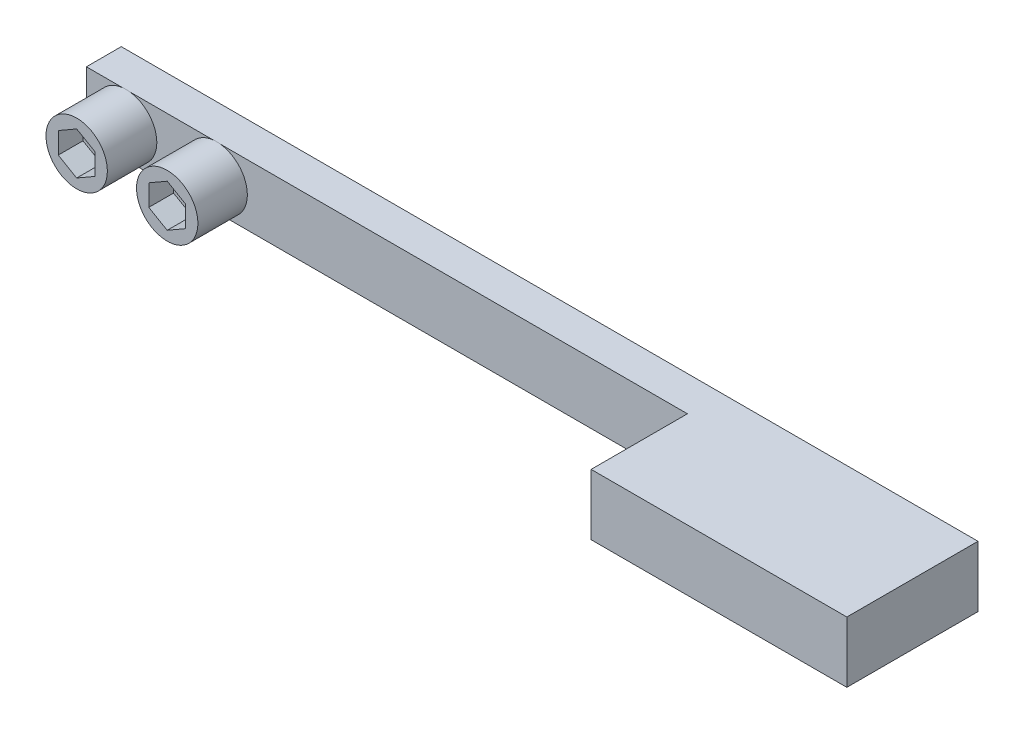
from build123d import *

# Parameters (mm, degrees)
EXTRUDE1_DEPTH     = 3.5052
SKETCH2_R          = 1.7653
EXTRUDE2_DEPTH     = 2.8448
CUT_EXTRUDE1_DEPTH = 1.4224
SKETCH4_R          = 1.7653
EXTRUDE3_DEPTH     = 2.8448
CUT_EXTRUDE2_DEPTH = 1.4224


with BuildPart() as part:
    # Sketch1 → Extrude1 (new body)
    with BuildSketch(Plane(origin=(0, -1.7526, 0), x_dir=(-1, 0, 0), z_dir=(0, 1, 0))):
        Polygon((24.638, -1.0033), (24.638, 1.0033), (-9.9314, 1.0033), (-9.9314, 6.5405), (-24.638, 6.5405), (-24.638, -1.0033), align=None)
    extrude(amount=EXTRUDE1_DEPTH)

    # Sketch2 → Extrude2 (add)
    with BuildSketch(Plane.XY.offset(1.0033)):
        with Locations(Location((-22.352, 0, 0), (0, 0, 96.876872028))):
            Circle(SKETCH2_R)
    extrude(amount=EXTRUDE2_DEPTH)

    # Sketch3 → Cut-Extrude1 (cut)
    with BuildSketch(Plane.XY.offset(3.8481)):
        Polygon((-23.41118, 0.611517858), (-23.41118, -0.611517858), (-22.352, -1.223035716), (-21.29282, -0.611517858), (-21.29282, 0.611517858), (-22.352, 1.223035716), align=None)
    extrude(amount=-CUT_EXTRUDE1_DEPTH, mode=Mode.SUBTRACT)

    # Sketch4 → Extrude3 (add)
    with BuildSketch(Plane.XY.offset(1.0033)):
        with Locations(Location((-17.145, 0, 0), (0, 0, 96.876872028))):
            Circle(SKETCH4_R)
    extrude(amount=EXTRUDE3_DEPTH)

    # Sketch5 → Cut-Extrude2 (cut)
    with BuildSketch(Plane.XY.offset(3.8481)):
        Polygon((-18.20418, 0.611517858), (-18.20418, -0.611517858), (-17.145, -1.223035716), (-16.08582, -0.611517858), (-16.08582, 0.611517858), (-17.145, 1.223035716), align=None)
    extrude(amount=-CUT_EXTRUDE2_DEPTH, mode=Mode.SUBTRACT)


solid = part.part
